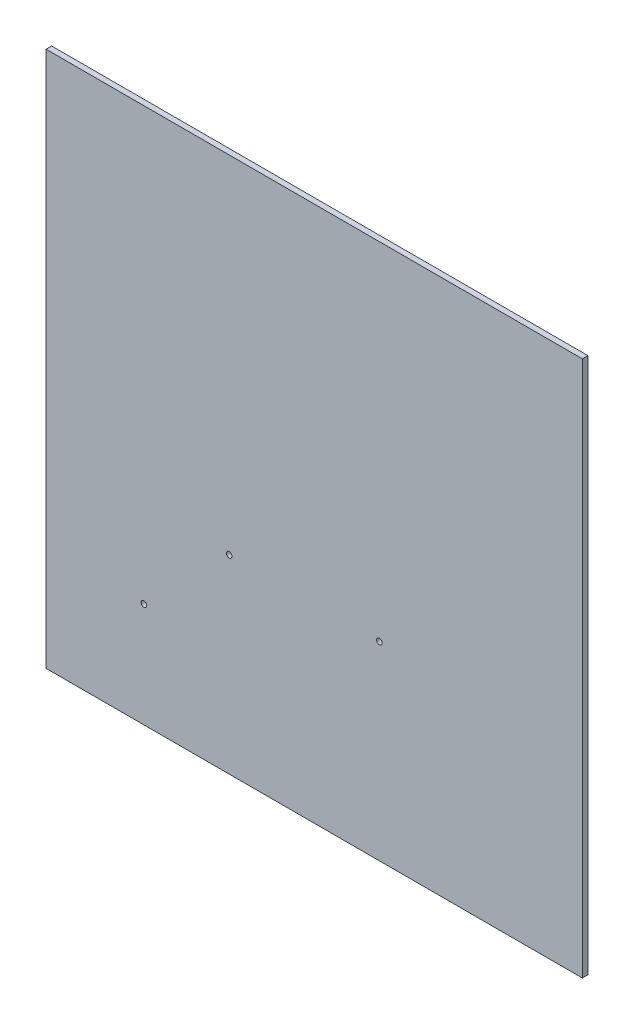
from build123d import *

# Parameters (mm, degrees)
SKETCH1_W           = 304.8
SKETCH1_H           = 304.8
SKETCH1_R           = 1.5875
BOSS_EXTRUDE1_DEPTH = 3.175


with BuildPart() as part:
    # Sketch1 → Boss-Extrude1 (new body)
    with BuildSketch(Plane.XY):
        with Locations((152.4, 152.4)):
            Rectangle(SKETCH1_W, SKETCH1_H)
        with Locations((104.077318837, 107.973535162)):
            Circle(SKETCH1_R, mode=Mode.SUBTRACT)
        with Locations((189.421318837, 107.973535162)):
            Circle(SKETCH1_R, mode=Mode.SUBTRACT)
        with Locations((55.583935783, 59.480152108)):
            Circle(SKETCH1_R, mode=Mode.SUBTRACT)
    extrude(amount=BOSS_EXTRUDE1_DEPTH)


solid = part.part
